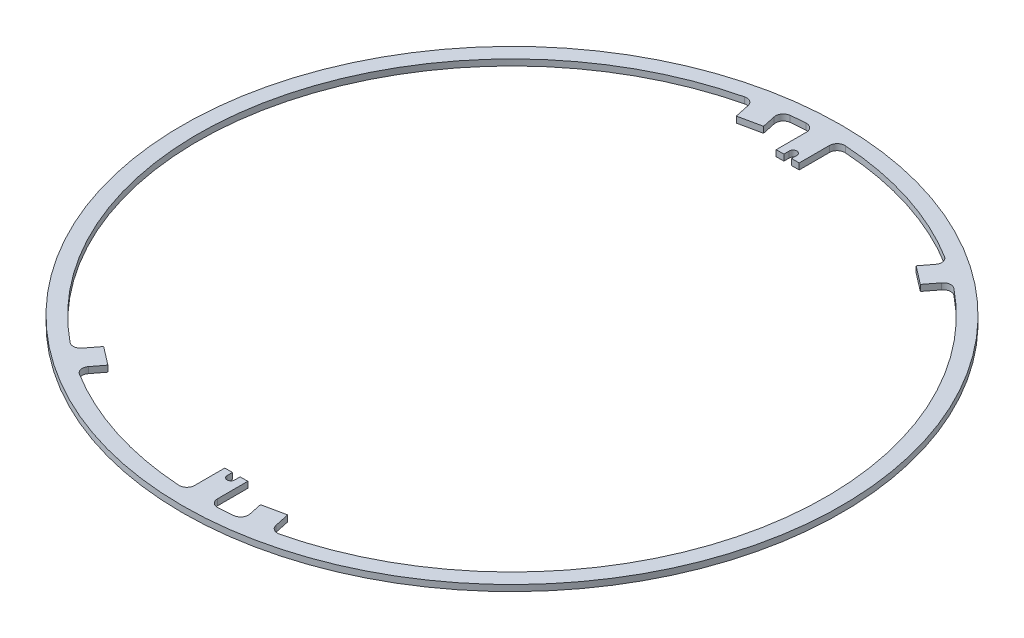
ISO-10303-21;
HEADER;
FILE_DESCRIPTION(('STEP AP214'),'2;1');
FILE_NAME('part.step','',(''),(''),'','','');
FILE_SCHEMA(('AUTOMOTIVE_DESIGN { 1 0 10303 214 1 1 1 1 }'));
ENDSEC;
DATA;
#1=APPLICATION_CONTEXT('core data for automotive mechanical design processes');
#2=APPLICATION_PROTOCOL_DEFINITION('international standard','automotive_design',2000,#1);
#3=PRODUCT_CONTEXT('',#1,'mechanical');
#4=PRODUCT('Part','Part','',(#3));
#5=PRODUCT_RELATED_PRODUCT_CATEGORY('part','',(#4));
#6=PRODUCT_DEFINITION_FORMATION('','',#4);
#7=PRODUCT_DEFINITION_CONTEXT('part definition',#1,'design');
#8=PRODUCT_DEFINITION('design','',#6,#7);
#9=PRODUCT_DEFINITION_SHAPE('','',#8);
#10=(LENGTH_UNIT() NAMED_UNIT(*) SI_UNIT(.MILLI.,.METRE.));
#11=(NAMED_UNIT(*) PLANE_ANGLE_UNIT() SI_UNIT($,.RADIAN.));
#12=(NAMED_UNIT(*) SI_UNIT($,.STERADIAN.) SOLID_ANGLE_UNIT());
#13=UNCERTAINTY_MEASURE_WITH_UNIT(LENGTH_MEASURE(1.E-05),#10,'distance_accuracy_value','');
#14=(GEOMETRIC_REPRESENTATION_CONTEXT(3) GLOBAL_UNCERTAINTY_ASSIGNED_CONTEXT((#13)) GLOBAL_UNIT_ASSIGNED_CONTEXT((#10,
#11,#12)) REPRESENTATION_CONTEXT('',''));
#15=CARTESIAN_POINT('',(0.,0.,0.));
#16=DIRECTION('',(0.,0.,1.));
#17=DIRECTION('',(1.,0.,0.));
#18=AXIS2_PLACEMENT_3D('',#15,#16,#17);
#19=CARTESIAN_POINT('',(0.,0.8,0.));
#20=DIRECTION('',(0.,-1.,0.));
#21=DIRECTION('',(0.,0.,-1.));
#22=AXIS2_PLACEMENT_3D('',#19,#20,#21);
#23=CYLINDRICAL_SURFACE('',#22,41.);
#24=CARTESIAN_POINT('',(0.,0.8,0.));
#25=DIRECTION('',(0.,1.,0.));
#26=DIRECTION('',(0.,0.,1.));
#27=AXIS2_PLACEMENT_3D('',#24,#25,#26);
#28=CIRCLE('',#27,41.);
#29=CARTESIAN_POINT('',(-2.5625,0.8,-40.9198435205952));
#30=VERTEX_POINT('',#29);
#31=CARTESIAN_POINT('',(-4.47124517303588,0.8,-40.7554654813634));
#32=VERTEX_POINT('',#31);
#33=EDGE_CURVE('E508',#30,#32,#28,.T.);
#34=ORIENTED_EDGE('',*,*,#33,.T.);
#35=DIRECTION('',(0.,-1.,0.));
#36=VECTOR('',#35,1.);
#37=CARTESIAN_POINT('',(-4.47124517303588,0.8,-40.7554654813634));
#38=LINE('',#37,#36);
#39=CARTESIAN_POINT('',(-4.47124517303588,0.,-40.7554654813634));
#40=VERTEX_POINT('',#39);
#41=EDGE_CURVE('E610',#32,#40,#38,.T.);
#42=ORIENTED_EDGE('',*,*,#41,.T.);
#43=CARTESIAN_POINT('',(0.,0.,0.));
#44=DIRECTION('',(0.,1.,0.));
#45=DIRECTION('',(0.,0.,1.));
#46=AXIS2_PLACEMENT_3D('',#43,#44,#45);
#47=CIRCLE('',#46,41.);
#48=CARTESIAN_POINT('',(-2.5625,0.,-40.9198435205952));
#49=VERTEX_POINT('',#48);
#50=EDGE_CURVE('E514',#49,#40,#47,.T.);
#51=ORIENTED_EDGE('',*,*,#50,.F.);
#52=DIRECTION('',(0.,-1.,0.));
#53=VECTOR('',#52,1.);
#54=CARTESIAN_POINT('',(-2.5625,0.8,-40.9198435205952));
#55=LINE('',#54,#53);
#56=EDGE_CURVE('E526',#49,#30,#55,.F.);
#57=ORIENTED_EDGE('',*,*,#56,.T.);
#58=EDGE_LOOP('',(#34,#42,#51,#57));
#59=FACE_BOUND('',#58,.T.);
#60=ADVANCED_FACE('F37',(#59),#23,.F.);
#61=CARTESIAN_POINT('',(9.52431632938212,0.,39.8784076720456));
#62=VERTEX_POINT('',#61);
#63=CARTESIAN_POINT('',(25.7646047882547,0.,-31.8933400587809));
#64=VERTEX_POINT('',#63);
#65=EDGE_CURVE('E513',#62,#64,#47,.T.);
#66=ORIENTED_EDGE('',*,*,#65,.F.);
#67=DIRECTION('',(0.,-1.,0.));
#68=VECTOR('',#67,1.);
#69=CARTESIAN_POINT('',(9.52431632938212,0.8,39.8784076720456));
#70=LINE('',#69,#68);
#71=CARTESIAN_POINT('',(9.52431632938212,0.8,39.8784076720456));
#72=VERTEX_POINT('',#71);
#73=EDGE_CURVE('E58',#62,#72,#70,.F.);
#74=ORIENTED_EDGE('',*,*,#73,.T.);
#75=CARTESIAN_POINT('',(25.7646047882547,0.8,-31.8933400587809));
#76=VERTEX_POINT('',#75);
#77=EDGE_CURVE('E507',#72,#76,#28,.T.);
#78=ORIENTED_EDGE('',*,*,#77,.T.);
#79=DIRECTION('',(0.,-1.,0.));
#80=VECTOR('',#79,1.);
#81=CARTESIAN_POINT('',(25.7646047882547,0.8,-31.8933400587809));
#82=LINE('',#81,#80);
#83=EDGE_CURVE('E573',#76,#64,#82,.T.);
#84=ORIENTED_EDGE('',*,*,#83,.T.);
#85=EDGE_LOOP('',(#66,#74,#78,#84));
#86=FACE_BOUND('',#85,.T.);
#87=ADVANCED_FACE('F727',(#86),#23,.F.);
#88=CARTESIAN_POINT('',(2.5625,0.8,40.9198435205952));
#89=VERTEX_POINT('',#88);
#90=CARTESIAN_POINT('',(4.47124517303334,0.8,40.7554654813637));
#91=VERTEX_POINT('',#90);
#92=EDGE_CURVE('E503',#89,#91,#28,.T.);
#93=ORIENTED_EDGE('',*,*,#92,.T.);
#94=DIRECTION('',(0.,-1.,0.));
#95=VECTOR('',#94,1.);
#96=CARTESIAN_POINT('',(4.47124517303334,0.8,40.7554654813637));
#97=LINE('',#96,#95);
#98=CARTESIAN_POINT('',(4.47124517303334,0.,40.7554654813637));
#99=VERTEX_POINT('',#98);
#100=EDGE_CURVE('E618',#91,#99,#97,.T.);
#101=ORIENTED_EDGE('',*,*,#100,.T.);
#102=CARTESIAN_POINT('',(2.5625,0.,40.9198435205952));
#103=VERTEX_POINT('',#102);
#104=EDGE_CURVE('E509',#103,#99,#47,.T.);
#105=ORIENTED_EDGE('',*,*,#104,.F.);
#106=DIRECTION('',(0.,-1.,0.));
#107=VECTOR('',#106,1.);
#108=CARTESIAN_POINT('',(2.5625,0.8,40.9198435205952));
#109=LINE('',#108,#107);
#110=EDGE_CURVE('E540',#103,#89,#109,.F.);
#111=ORIENTED_EDGE('',*,*,#110,.T.);
#112=EDGE_LOOP('',(#93,#101,#105,#111));
#113=FACE_BOUND('',#112,.T.);
#114=ADVANCED_FACE('F649',(#113),#23,.F.);
#115=CARTESIAN_POINT('',(-9.52431632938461,0.,-39.878407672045));
#116=VERTEX_POINT('',#115);
#117=CARTESIAN_POINT('',(-25.7646047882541,0.,31.8933400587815));
#118=VERTEX_POINT('',#117);
#119=EDGE_CURVE('E757',#116,#118,#47,.T.);
#120=ORIENTED_EDGE('',*,*,#119,.F.);
#121=DIRECTION('',(0.,-1.,0.));
#122=VECTOR('',#121,1.);
#123=CARTESIAN_POINT('',(-9.52431632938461,0.8,-39.878407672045));
#124=LINE('',#123,#122);
#125=CARTESIAN_POINT('',(-9.52431632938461,0.8,-39.878407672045));
#126=VERTEX_POINT('',#125);
#127=EDGE_CURVE('E616',#116,#126,#124,.F.);
#128=ORIENTED_EDGE('',*,*,#127,.T.);
#129=CARTESIAN_POINT('',(-25.7646047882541,0.8,31.8933400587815));
#130=VERTEX_POINT('',#129);
#131=EDGE_CURVE('E669',#126,#130,#28,.T.);
#132=ORIENTED_EDGE('',*,*,#131,.T.);
#133=DIRECTION('',(0.,-1.,0.));
#134=VECTOR('',#133,1.);
#135=CARTESIAN_POINT('',(-25.7646047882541,0.8,31.8933400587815));
#136=LINE('',#135,#134);
#137=EDGE_CURVE('E589',#130,#118,#136,.T.);
#138=ORIENTED_EDGE('',*,*,#137,.T.);
#139=EDGE_LOOP('',(#120,#128,#132,#138));
#140=FACE_BOUND('',#139,.T.);
#141=ADVANCED_FACE('F743',(#140),#23,.F.);
#142=CARTESIAN_POINT('',(0.,-5.85450557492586,35.9725517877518));
#143=DIRECTION('',(0.,0.,1.));
#144=DIRECTION('',(1.,0.,0.));
#145=AXIS2_PLACEMENT_3D('',#142,#143,#144);
#146=PLANE('',#145);
#147=DIRECTION('',(-1.,0.,0.));
#148=VECTOR('',#147,1.);
#149=CARTESIAN_POINT('',(0.,0.,35.9725517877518));
#150=LINE('',#149,#148);
#151=CARTESIAN_POINT('',(1.5,0.,35.9725517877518));
#152=VERTEX_POINT('',#151);
#153=CARTESIAN_POINT('',(0.5,0.,35.9725517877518));
#154=VERTEX_POINT('',#153);
#155=EDGE_CURVE('E483',#152,#154,#150,.T.);
#156=ORIENTED_EDGE('',*,*,#155,.T.);
#157=DIRECTION('',(0.,1.,0.));
#158=VECTOR('',#157,1.);
#159=CARTESIAN_POINT('',(0.5,-5.85450557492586,35.9725517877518));
#160=LINE('',#159,#158);
#161=CARTESIAN_POINT('',(0.5,0.8,35.9725517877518));
#162=VERTEX_POINT('',#161);
#163=EDGE_CURVE('E567',#154,#162,#160,.T.);
#164=ORIENTED_EDGE('',*,*,#163,.T.);
#165=DIRECTION('',(1.,0.,0.));
#166=VECTOR('',#165,1.);
#167=CARTESIAN_POINT('',(0.,0.8,35.9725517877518));
#168=LINE('',#167,#166);
#169=CARTESIAN_POINT('',(1.5,0.8,35.9725517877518));
#170=VERTEX_POINT('',#169);
#171=EDGE_CURVE('E464',#162,#170,#168,.T.);
#172=ORIENTED_EDGE('',*,*,#171,.T.);
#173=DIRECTION('',(0.,1.,0.));
#174=VECTOR('',#173,1.);
#175=CARTESIAN_POINT('',(1.5,-5.85450557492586,35.9725517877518));
#176=LINE('',#175,#174);
#177=EDGE_CURVE('E496',#152,#170,#176,.T.);
#178=ORIENTED_EDGE('',*,*,#177,.F.);
#179=EDGE_LOOP('',(#156,#164,#172,#178));
#180=FACE_BOUND('',#179,.T.);
#181=ADVANCED_FACE('F704',(#180),#146,.F.);
#182=CARTESIAN_POINT('',(0.,-5.85450557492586,-35.9725517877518));
#183=DIRECTION('',(0.,0.,1.));
#184=DIRECTION('',(1.,0.,0.));
#185=AXIS2_PLACEMENT_3D('',#182,#183,#184);
#186=PLANE('',#185);
#187=DIRECTION('',(0.,-1.,0.));
#188=VECTOR('',#187,1.);
#189=CARTESIAN_POINT('',(-0.5,-5.85450557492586,-35.9725517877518));
#190=LINE('',#189,#188);
#191=CARTESIAN_POINT('',(-0.5,0.8,-35.9725517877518));
#192=VERTEX_POINT('',#191);
#193=CARTESIAN_POINT('',(-0.5,0.,-35.9725517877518));
#194=VERTEX_POINT('',#193);
#195=EDGE_CURVE('E562',#192,#194,#190,.T.);
#196=ORIENTED_EDGE('',*,*,#195,.F.);
#197=DIRECTION('',(1.,0.,0.));
#198=VECTOR('',#197,1.);
#199=CARTESIAN_POINT('',(0.,0.8,-35.9725517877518));
#200=LINE('',#199,#198);
#201=CARTESIAN_POINT('',(-1.5,0.8,-35.9725517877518));
#202=VERTEX_POINT('',#201);
#203=EDGE_CURVE('E470',#202,#192,#200,.T.);
#204=ORIENTED_EDGE('',*,*,#203,.F.);
#205=DIRECTION('',(0.,1.,0.));
#206=VECTOR('',#205,1.);
#207=CARTESIAN_POINT('',(-1.5,-5.85450557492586,-35.9725517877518));
#208=LINE('',#207,#206);
#209=CARTESIAN_POINT('',(-1.5,0.,-35.9725517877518));
#210=VERTEX_POINT('',#209);
#211=EDGE_CURVE('E473',#210,#202,#208,.T.);
#212=ORIENTED_EDGE('',*,*,#211,.F.);
#213=DIRECTION('',(-1.,0.,0.));
#214=VECTOR('',#213,1.);
#215=CARTESIAN_POINT('',(0.,0.,-35.9725517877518));
#216=LINE('',#215,#214);
#217=EDGE_CURVE('E456',#194,#210,#216,.T.);
#218=ORIENTED_EDGE('',*,*,#217,.F.);
#219=EDGE_LOOP('',(#196,#204,#212,#218));
#220=FACE_BOUND('',#219,.T.);
#221=ADVANCED_FACE('F741',(#220),#186,.T.);
#222=CARTESIAN_POINT('',(21.5813602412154,0.,-34.8603627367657));
#223=VERTEX_POINT('',#222);
#224=CARTESIAN_POINT('',(2.5625,0.,-40.9198435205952));
#225=VERTEX_POINT('',#224);
#226=EDGE_CURVE('E1201',#223,#225,#47,.T.);
#227=ORIENTED_EDGE('',*,*,#226,.F.);
#228=DIRECTION('',(0.,-1.,0.));
#229=VECTOR('',#228,1.);
#230=CARTESIAN_POINT('',(21.5813602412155,0.8,-34.8603627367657));
#231=LINE('',#230,#229);
#232=CARTESIAN_POINT('',(21.5813602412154,0.8,-34.8603627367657));
#233=VERTEX_POINT('',#232);
#234=EDGE_CURVE('E576',#223,#233,#231,.F.);
#235=ORIENTED_EDGE('',*,*,#234,.T.);
#236=CARTESIAN_POINT('',(2.5625,0.8,-40.9198435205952));
#237=VERTEX_POINT('',#236);
#238=EDGE_CURVE('E668',#233,#237,#28,.T.);
#239=ORIENTED_EDGE('',*,*,#238,.T.);
#240=DIRECTION('',(0.,-1.,0.));
#241=VECTOR('',#240,1.);
#242=CARTESIAN_POINT('',(2.5625,0.8,-40.9198435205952));
#243=LINE('',#242,#241);
#244=EDGE_CURVE('E523',#237,#225,#243,.T.);
#245=ORIENTED_EDGE('',*,*,#244,.T.);
#246=EDGE_LOOP('',(#227,#235,#239,#245));
#247=FACE_BOUND('',#246,.T.);
#248=ADVANCED_FACE('F736',(#247),#23,.F.);
#249=CARTESIAN_POINT('',(-21.5813602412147,0.,34.8603627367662));
#250=VERTEX_POINT('',#249);
#251=CARTESIAN_POINT('',(-2.5625,0.,40.9198435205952));
#252=VERTEX_POINT('',#251);
#253=EDGE_CURVE('E486',#250,#252,#47,.T.);
#254=ORIENTED_EDGE('',*,*,#253,.F.);
#255=DIRECTION('',(0.,-1.,0.));
#256=VECTOR('',#255,1.);
#257=CARTESIAN_POINT('',(-21.5813602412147,0.8,34.8603627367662));
#258=LINE('',#257,#256);
#259=CARTESIAN_POINT('',(-21.5813602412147,0.8,34.8603627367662));
#260=VERTEX_POINT('',#259);
#261=EDGE_CURVE('E581',#250,#260,#258,.F.);
#262=ORIENTED_EDGE('',*,*,#261,.T.);
#263=CARTESIAN_POINT('',(-2.5625,0.8,40.9198435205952));
#264=VERTEX_POINT('',#263);
#265=EDGE_CURVE('E512',#260,#264,#28,.T.);
#266=ORIENTED_EDGE('',*,*,#265,.T.);
#267=DIRECTION('',(0.,-1.,0.));
#268=VECTOR('',#267,1.);
#269=CARTESIAN_POINT('',(-2.5625,0.8,40.9198435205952));
#270=LINE('',#269,#268);
#271=EDGE_CURVE('E548',#264,#252,#270,.T.);
#272=ORIENTED_EDGE('',*,*,#271,.T.);
#273=EDGE_LOOP('',(#254,#262,#266,#272));
#274=FACE_BOUND('',#273,.T.);
#275=ADVANCED_FACE('F676',(#274),#23,.F.);
#276=CARTESIAN_POINT('',(0.,0.8,0.));
#277=DIRECTION('',(0.,1.,0.));
#278=DIRECTION('',(0.,0.,1.));
#279=AXIS2_PLACEMENT_3D('',#276,#277,#278);
#280=PLANE('',#279);
#281=DIRECTION('',(0.,0.,1.));
#282=VECTOR('',#281,1.);
#283=CARTESIAN_POINT('',(0.5,0.8,33.6725517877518));
#284=LINE('',#283,#282);
#285=CARTESIAN_POINT('',(0.5,0.8,36.6725517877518));
#286=VERTEX_POINT('',#285);
#287=EDGE_CURVE('E418',#162,#286,#284,.T.);
#288=ORIENTED_EDGE('',*,*,#287,.T.);
#289=CARTESIAN_POINT('',(0.,0.8,36.6725517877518));
#290=DIRECTION('',(0.,-1.,0.));
#291=DIRECTION('',(0.,0.,-1.));
#292=AXIS2_PLACEMENT_3D('',#289,#290,#291);
#293=CIRCLE('',#292,0.5);
#294=CARTESIAN_POINT('',(-0.5,0.8,36.6725517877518));
#295=VERTEX_POINT('',#294);
#296=EDGE_CURVE('E411',#286,#295,#293,.T.);
#297=ORIENTED_EDGE('',*,*,#296,.T.);
#298=DIRECTION('',(0.,0.,-1.));
#299=VECTOR('',#298,1.);
#300=CARTESIAN_POINT('',(-0.5,0.8,36.6725517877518));
#301=LINE('',#300,#299);
#302=CARTESIAN_POINT('',(-0.5,0.8,35.9725517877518));
#303=VERTEX_POINT('',#302);
#304=EDGE_CURVE('E414',#295,#303,#301,.T.);
#305=ORIENTED_EDGE('',*,*,#304,.T.);
#306=CARTESIAN_POINT('',(-1.5,0.8,35.9725517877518));
#307=VERTEX_POINT('',#306);
#308=EDGE_CURVE('E487',#307,#303,#168,.T.);
#309=ORIENTED_EDGE('',*,*,#308,.F.);
#310=DIRECTION('',(0.,0.,-1.));
#311=VECTOR('',#310,1.);
#312=CARTESIAN_POINT('',(-1.49999999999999,0.8,0.));
#313=LINE('',#312,#311);
#314=CARTESIAN_POINT('',(-1.5,0.8,39.9217985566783));
#315=VERTEX_POINT('',#314);
#316=EDGE_CURVE('E490',#315,#307,#313,.T.);
#317=ORIENTED_EDGE('',*,*,#316,.F.);
#318=CARTESIAN_POINT('',(-2.5,0.8,39.9217985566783));
#319=DIRECTION('',(0.,1.,0.));
#320=DIRECTION('',(0.,0.,1.));
#321=AXIS2_PLACEMENT_3D('',#318,#319,#320);
#322=CIRCLE('',#321,1.);
#323=EDGE_CURVE('E555',#315,#264,#322,.F.);
#324=ORIENTED_EDGE('',*,*,#323,.T.);
#325=ORIENTED_EDGE('',*,*,#265,.F.);
#326=CARTESIAN_POINT('',(-21.0549856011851,0.8,34.0101099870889));
#327=DIRECTION('',(0.,1.,0.));
#328=DIRECTION('',(0.,0.,1.));
#329=AXIS2_PLACEMENT_3D('',#326,#327,#328);
#330=CIRCLE('',#329,1.);
#331=CARTESIAN_POINT('',(-21.8483389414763,0.8,33.4013485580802));
#332=VERTEX_POINT('',#331);
#333=EDGE_CURVE('E601',#260,#332,#330,.F.);
#334=ORIENTED_EDGE('',*,*,#333,.T.);
#335=DIRECTION('',(0.608761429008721,0.,-0.793353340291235));
#336=VECTOR('',#335,1.);
#337=CARTESIAN_POINT('',(-20.7528742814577,0.8,31.9737112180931));
#338=LINE('',#337,#336);
#339=CARTESIAN_POINT('',(-20.7528742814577,0.8,31.9737112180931));
#340=VERTEX_POINT('',#339);
#341=EDGE_CURVE('E390',#332,#340,#338,.T.);
#342=ORIENTED_EDGE('',*,*,#341,.T.);
#343=DIRECTION('',(-0.793353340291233,0.,-0.608761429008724));
#344=VECTOR('',#343,1.);
#345=CARTESIAN_POINT('',(-23.1329343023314,0.8,30.1474269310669));
#346=LINE('',#345,#344);
#347=CARTESIAN_POINT('',(-23.1329343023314,0.8,30.1474269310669));
#348=VERTEX_POINT('',#347);
#349=EDGE_CURVE('E398',#340,#348,#346,.T.);
#350=ORIENTED_EDGE('',*,*,#349,.T.);
#351=DIRECTION('',(-0.60876142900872,0.,0.793353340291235));
#352=VECTOR('',#351,1.);
#353=CARTESIAN_POINT('',(-24.9592185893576,0.8,32.5274869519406));
#354=LINE('',#353,#352);
#355=CARTESIAN_POINT('',(-24.3428464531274,0.8,31.7242151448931));
#356=VERTEX_POINT('',#355);
#357=EDGE_CURVE('E401',#348,#356,#354,.T.);
#358=ORIENTED_EDGE('',*,*,#357,.T.);
#359=CARTESIAN_POINT('',(-25.1361997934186,0.8,31.1154537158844));
#360=DIRECTION('',(0.,1.,0.));
#361=DIRECTION('',(0.,0.,1.));
#362=AXIS2_PLACEMENT_3D('',#359,#360,#361);
#363=CIRCLE('',#362,1.);
#364=EDGE_CURVE('E605',#356,#130,#363,.F.);
#365=ORIENTED_EDGE('',*,*,#364,.T.);
#366=ORIENTED_EDGE('',*,*,#131,.F.);
#367=CARTESIAN_POINT('',(-9.29201593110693,0.8,-38.9057635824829));
#368=DIRECTION('',(0.,1.,0.));
#369=DIRECTION('',(0.,0.,1.));
#370=AXIS2_PLACEMENT_3D('',#367,#368,#369);
#371=CIRCLE('',#370,1.);
#372=CARTESIAN_POINT('',(-8.31386833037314,0.8,-39.1136752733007));
#373=VERTEX_POINT('',#372);
#374=EDGE_CURVE('E633',#126,#373,#371,.F.);
#375=ORIENTED_EDGE('',*,*,#374,.T.);
#376=DIRECTION('',(-0.207911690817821,0.,-0.978147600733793));
#377=VECTOR('',#376,1.);
#378=CARTESIAN_POINT('',(-8.52437932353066,0.8,-40.1040516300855));
#379=LINE('',#378,#377);
#380=CARTESIAN_POINT('',(-7.9006442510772,0.8,-37.1696088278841));
#381=VERTEX_POINT('',#380);
#382=EDGE_CURVE('E327',#381,#373,#379,.T.);
#383=ORIENTED_EDGE('',*,*,#382,.F.);
#384=DIRECTION('',(-0.978147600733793,0.,0.20791169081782));
#385=VECTOR('',#384,1.);
#386=CARTESIAN_POINT('',(-7.9006442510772,0.8,-37.1696088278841));
#387=LINE('',#386,#385);
#388=CARTESIAN_POINT('',(-4.96620144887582,0.8,-37.7933439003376));
#389=VERTEX_POINT('',#388);
#390=EDGE_CURVE('E324',#389,#381,#387,.T.);
#391=ORIENTED_EDGE('',*,*,#390,.F.);
#392=DIRECTION('',(0.20791169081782,0.,0.978147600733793));
#393=VECTOR('',#392,1.);
#394=CARTESIAN_POINT('',(-4.96620144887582,0.8,-37.7933439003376));
#395=LINE('',#394,#393);
#396=CARTESIAN_POINT('',(-5.34033801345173,0.8,-39.5535180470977));
#397=VERTEX_POINT('',#396);
#398=EDGE_CURVE('E341',#397,#389,#395,.T.);
#399=ORIENTED_EDGE('',*,*,#398,.F.);
#400=CARTESIAN_POINT('',(-4.36219041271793,0.8,-39.7614297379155));
#401=DIRECTION('',(0.,1.,0.));
#402=DIRECTION('',(0.,0.,1.));
#403=AXIS2_PLACEMENT_3D('',#400,#401,#402);
#404=CIRCLE('',#403,1.);
#405=EDGE_CURVE('E629',#397,#32,#404,.F.);
#406=ORIENTED_EDGE('',*,*,#405,.T.);
#407=ORIENTED_EDGE('',*,*,#33,.F.);
#408=CARTESIAN_POINT('',(-2.5,0.8,-39.9217985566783));
#409=DIRECTION('',(0.,1.,0.));
#410=DIRECTION('',(0.,0.,1.));
#411=AXIS2_PLACEMENT_3D('',#408,#409,#410);
#412=CIRCLE('',#411,1.);
#413=CARTESIAN_POINT('',(-1.5,0.8,-39.9217985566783));
#414=VERTEX_POINT('',#413);
#415=EDGE_CURVE('E536',#30,#414,#412,.F.);
#416=ORIENTED_EDGE('',*,*,#415,.T.);
#417=DIRECTION('',(0.,0.,1.));
#418=VECTOR('',#417,1.);
#419=CARTESIAN_POINT('',(-1.49999999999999,0.8,0.));
#420=LINE('',#419,#418);
#421=EDGE_CURVE('E467',#414,#202,#420,.T.);
#422=ORIENTED_EDGE('',*,*,#421,.T.);
#423=ORIENTED_EDGE('',*,*,#203,.T.);
#424=DIRECTION('',(0.,0.,-1.));
#425=VECTOR('',#424,1.);
#426=CARTESIAN_POINT('',(-0.5,0.8,-36.6725517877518));
#427=LINE('',#426,#425);
#428=CARTESIAN_POINT('',(-0.5,0.8,-36.6725517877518));
#429=VERTEX_POINT('',#428);
#430=EDGE_CURVE('E441',#192,#429,#427,.T.);
#431=ORIENTED_EDGE('',*,*,#430,.T.);
#432=CARTESIAN_POINT('',(0.,0.8,-36.6725517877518));
#433=DIRECTION('',(0.,-1.,0.));
#434=DIRECTION('',(0.,0.,1.));
#435=AXIS2_PLACEMENT_3D('',#432,#433,#434);
#436=CIRCLE('',#435,0.5);
#437=CARTESIAN_POINT('',(0.5,0.8,-36.6725517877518));
#438=VERTEX_POINT('',#437);
#439=EDGE_CURVE('E434',#429,#438,#436,.T.);
#440=ORIENTED_EDGE('',*,*,#439,.T.);
#441=DIRECTION('',(0.,0.,1.));
#442=VECTOR('',#441,1.);
#443=CARTESIAN_POINT('',(0.5,0.8,-33.6725517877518));
#444=LINE('',#443,#442);
#445=CARTESIAN_POINT('',(0.5,0.8,-35.9725517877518));
#446=VERTEX_POINT('',#445);
#447=EDGE_CURVE('E437',#438,#446,#444,.T.);
#448=ORIENTED_EDGE('',*,*,#447,.T.);
#449=CARTESIAN_POINT('',(1.5,0.8,-35.9725517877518));
#450=VERTEX_POINT('',#449);
#451=EDGE_CURVE('E469',#446,#450,#200,.T.);
#452=ORIENTED_EDGE('',*,*,#451,.T.);
#453=DIRECTION('',(0.,0.,1.));
#454=VECTOR('',#453,1.);
#455=CARTESIAN_POINT('',(1.49999999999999,0.8,0.));
#456=LINE('',#455,#454);
#457=CARTESIAN_POINT('',(1.5,0.8,-39.9217985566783));
#458=VERTEX_POINT('',#457);
#459=EDGE_CURVE('E432',#458,#450,#456,.T.);
#460=ORIENTED_EDGE('',*,*,#459,.F.);
#461=CARTESIAN_POINT('',(2.5,0.8,-39.9217985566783));
#462=DIRECTION('',(0.,1.,0.));
#463=DIRECTION('',(0.,0.,1.));
#464=AXIS2_PLACEMENT_3D('',#461,#462,#463);
#465=CIRCLE('',#464,1.);
#466=EDGE_CURVE('E531',#458,#237,#465,.F.);
#467=ORIENTED_EDGE('',*,*,#466,.T.);
#468=ORIENTED_EDGE('',*,*,#238,.F.);
#469=CARTESIAN_POINT('',(21.0549856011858,0.8,-34.0101099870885));
#470=DIRECTION('',(0.,1.,0.));
#471=DIRECTION('',(0.,0.,1.));
#472=AXIS2_PLACEMENT_3D('',#469,#470,#471);
#473=CIRCLE('',#472,1.);
#474=CARTESIAN_POINT('',(21.848338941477,0.8,-33.4013485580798));
#475=VERTEX_POINT('',#474);
#476=EDGE_CURVE('E597',#233,#475,#473,.F.);
#477=ORIENTED_EDGE('',*,*,#476,.T.);
#478=DIRECTION('',(-0.608761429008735,0.,0.793353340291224));
#479=VECTOR('',#478,1.);
#480=CARTESIAN_POINT('',(20.7528742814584,0.8,-31.9737112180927));
#481=LINE('',#480,#479);
#482=CARTESIAN_POINT('',(20.7528742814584,0.8,-31.9737112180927));
#483=VERTEX_POINT('',#482);
#484=EDGE_CURVE('E370',#475,#483,#481,.T.);
#485=ORIENTED_EDGE('',*,*,#484,.T.);
#486=DIRECTION('',(0.79335334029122,0.,0.60876142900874));
#487=VECTOR('',#486,1.);
#488=CARTESIAN_POINT('',(23.132934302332,0.8,-30.1474269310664));
#489=LINE('',#488,#487);
#490=CARTESIAN_POINT('',(23.132934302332,0.8,-30.1474269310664));
#491=VERTEX_POINT('',#490);
#492=EDGE_CURVE('E378',#483,#491,#489,.T.);
#493=ORIENTED_EDGE('',*,*,#492,.T.);
#494=DIRECTION('',(0.608761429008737,0.,-0.793353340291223));
#495=VECTOR('',#494,1.);
#496=CARTESIAN_POINT('',(24.9592185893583,0.8,-32.5274869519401));
#497=LINE('',#496,#495);
#498=CARTESIAN_POINT('',(24.342846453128,0.8,-31.7242151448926));
#499=VERTEX_POINT('',#498);
#500=EDGE_CURVE('E381',#491,#499,#497,.T.);
#501=ORIENTED_EDGE('',*,*,#500,.T.);
#502=CARTESIAN_POINT('',(25.1361997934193,0.8,-31.1154537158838));
#503=DIRECTION('',(0.,1.,0.));
#504=DIRECTION('',(0.,0.,1.));
#505=AXIS2_PLACEMENT_3D('',#502,#503,#504);
#506=CIRCLE('',#505,1.);
#507=EDGE_CURVE('E592',#499,#76,#506,.F.);
#508=ORIENTED_EDGE('',*,*,#507,.T.);
#509=ORIENTED_EDGE('',*,*,#77,.F.);
#510=CARTESIAN_POINT('',(9.29201593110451,0.8,38.9057635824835));
#511=DIRECTION('',(0.,1.,0.));
#512=DIRECTION('',(0.,0.,1.));
#513=AXIS2_PLACEMENT_3D('',#510,#511,#512);
#514=CIRCLE('',#513,1.);
#515=CARTESIAN_POINT('',(8.3138683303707,0.8,39.1136752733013));
#516=VERTEX_POINT('',#515);
#517=EDGE_CURVE('E11',#72,#516,#514,.F.);
#518=ORIENTED_EDGE('',*,*,#517,.T.);
#519=DIRECTION('',(0.207911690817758,0.,0.978147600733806));
#520=VECTOR('',#519,1.);
#521=CARTESIAN_POINT('',(8.52437932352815,0.8,40.104051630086));
#522=LINE('',#521,#520);
#523=CARTESIAN_POINT('',(7.90064425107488,0.8,37.1696088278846));
#524=VERTEX_POINT('',#523);
#525=EDGE_CURVE('E353',#524,#516,#522,.T.);
#526=ORIENTED_EDGE('',*,*,#525,.F.);
#527=DIRECTION('',(0.978147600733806,0.,-0.20791169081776));
#528=VECTOR('',#527,1.);
#529=CARTESIAN_POINT('',(7.90064425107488,0.8,37.1696088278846));
#530=LINE('',#529,#528);
#531=CARTESIAN_POINT('',(4.96620144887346,0.8,37.7933439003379));
#532=VERTEX_POINT('',#531);
#533=EDGE_CURVE('E361',#532,#524,#530,.T.);
#534=ORIENTED_EDGE('',*,*,#533,.F.);
#535=DIRECTION('',(-0.207911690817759,0.,-0.978147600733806));
#536=VECTOR('',#535,1.);
#537=CARTESIAN_POINT('',(4.96620144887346,0.8,37.7933439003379));
#538=LINE('',#537,#536);
#539=CARTESIAN_POINT('',(5.34033801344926,0.8,39.553518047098));
#540=VERTEX_POINT('',#539);
#541=EDGE_CURVE('E360',#540,#532,#538,.T.);
#542=ORIENTED_EDGE('',*,*,#541,.F.);
#543=CARTESIAN_POINT('',(4.36219041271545,0.8,39.7614297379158));
#544=DIRECTION('',(0.,1.,0.));
#545=DIRECTION('',(0.,0.,1.));
#546=AXIS2_PLACEMENT_3D('',#543,#544,#545);
#547=CIRCLE('',#546,1.);
#548=EDGE_CURVE('E637',#540,#91,#547,.F.);
#549=ORIENTED_EDGE('',*,*,#548,.T.);
#550=ORIENTED_EDGE('',*,*,#92,.F.);
#551=CARTESIAN_POINT('',(2.5,0.8,39.9217985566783));
#552=DIRECTION('',(0.,1.,0.));
#553=DIRECTION('',(0.,0.,1.));
#554=AXIS2_PLACEMENT_3D('',#551,#552,#553);
#555=CIRCLE('',#554,1.);
#556=CARTESIAN_POINT('',(1.5,0.8,39.9217985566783));
#557=VERTEX_POINT('',#556);
#558=EDGE_CURVE('E551',#89,#557,#555,.F.);
#559=ORIENTED_EDGE('',*,*,#558,.T.);
#560=DIRECTION('',(0.,0.,-1.));
#561=VECTOR('',#560,1.);
#562=CARTESIAN_POINT('',(1.49999999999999,0.8,0.));
#563=LINE('',#562,#561);
#564=EDGE_CURVE('E492',#557,#170,#563,.T.);
#565=ORIENTED_EDGE('',*,*,#564,.T.);
#566=ORIENTED_EDGE('',*,*,#171,.F.);
#567=EDGE_LOOP('',(#288,#297,#305,#309,#317,#324,#325,#334,#342,#350,#358,#365,#366,#375,#383,
#391,#399,#406,#407,#416,#422,#423,#431,#440,#448,#452,#460,#467,#468,#477,#485,#493,#501,#508,
#509,#518,#526,#534,#542,#549,#550,#559,#565,#566));
#568=FACE_BOUND('',#567,.T.);
#569=CARTESIAN_POINT('',(0.,0.8,0.));
#570=DIRECTION('',(0.,1.,0.));
#571=DIRECTION('',(0.,0.,1.));
#572=AXIS2_PLACEMENT_3D('',#569,#570,#571);
#573=CIRCLE('',#572,43.);
#574=CARTESIAN_POINT('',(0.,0.8,43.));
#575=VERTEX_POINT('',#574);
#576=EDGE_CURVE('E515',#575,#575,#573,.T.);
#577=ORIENTED_EDGE('',*,*,#576,.T.);
#578=EDGE_LOOP('',(#577));
#579=FACE_BOUND('',#578,.T.);
#580=ADVANCED_FACE('F642',(#568,#579),#280,.T.);
#581=CARTESIAN_POINT('',(0.,0.,0.));
#582=DIRECTION('',(0.,1.,0.));
#583=DIRECTION('',(0.,0.,1.));
#584=AXIS2_PLACEMENT_3D('',#581,#582,#583);
#585=PLANE('',#584);
#586=CARTESIAN_POINT('',(0.,0.,0.));
#587=DIRECTION('',(0.,1.,0.));
#588=DIRECTION('',(0.,0.,1.));
#589=AXIS2_PLACEMENT_3D('',#586,#587,#588);
#590=CIRCLE('',#589,43.);
#591=CARTESIAN_POINT('',(0.,0.,43.));
#592=VERTEX_POINT('',#591);
#593=EDGE_CURVE('E506',#592,#592,#590,.T.);
#594=ORIENTED_EDGE('',*,*,#593,.F.);
#595=EDGE_LOOP('',(#594));
#596=FACE_BOUND('',#595,.T.);
#597=CARTESIAN_POINT('',(0.,0.,36.6725517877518));
#598=DIRECTION('',(0.,-1.,0.));
#599=DIRECTION('',(0.,0.,-1.));
#600=AXIS2_PLACEMENT_3D('',#597,#598,#599);
#601=CIRCLE('',#600,0.5);
#602=CARTESIAN_POINT('',(0.5,0.,36.6725517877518));
#603=VERTEX_POINT('',#602);
#604=CARTESIAN_POINT('',(-0.5,0.,36.6725517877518));
#605=VERTEX_POINT('',#604);
#606=EDGE_CURVE('E422',#603,#605,#601,.T.);
#607=ORIENTED_EDGE('',*,*,#606,.F.);
#608=DIRECTION('',(0.,0.,1.));
#609=VECTOR('',#608,1.);
#610=CARTESIAN_POINT('',(0.5,0.,33.6725517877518));
#611=LINE('',#610,#609);
#612=EDGE_CURVE('E415',#154,#603,#611,.T.);
#613=ORIENTED_EDGE('',*,*,#612,.F.);
#614=ORIENTED_EDGE('',*,*,#155,.F.);
#615=DIRECTION('',(0.,0.,1.));
#616=VECTOR('',#615,1.);
#617=CARTESIAN_POINT('',(1.49999999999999,0.,0.));
#618=LINE('',#617,#616);
#619=CARTESIAN_POINT('',(1.5,0.,39.9217985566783));
#620=VERTEX_POINT('',#619);
#621=EDGE_CURVE('E478',#152,#620,#618,.T.);
#622=ORIENTED_EDGE('',*,*,#621,.T.);
#623=CARTESIAN_POINT('',(2.5,0.,39.9217985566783));
#624=DIRECTION('',(0.,1.,0.));
#625=DIRECTION('',(0.,0.,1.));
#626=AXIS2_PLACEMENT_3D('',#623,#624,#625);
#627=CIRCLE('',#626,1.);
#628=EDGE_CURVE('E553',#620,#103,#627,.T.);
#629=ORIENTED_EDGE('',*,*,#628,.T.);
#630=ORIENTED_EDGE('',*,*,#104,.T.);
#631=CARTESIAN_POINT('',(4.36219041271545,0.,39.7614297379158));
#632=DIRECTION('',(0.,1.,0.));
#633=DIRECTION('',(0.,0.,1.));
#634=AXIS2_PLACEMENT_3D('',#631,#632,#633);
#635=CIRCLE('',#634,1.);
#636=CARTESIAN_POINT('',(5.34033801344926,0.,39.553518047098));
#637=VERTEX_POINT('',#636);
#638=EDGE_CURVE('E635',#99,#637,#635,.T.);
#639=ORIENTED_EDGE('',*,*,#638,.T.);
#640=DIRECTION('',(-0.207911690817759,0.,-0.978147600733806));
#641=VECTOR('',#640,1.);
#642=CARTESIAN_POINT('',(4.96620144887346,0.,37.7933439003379));
#643=LINE('',#642,#641);
#644=CARTESIAN_POINT('',(4.96620144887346,0.,37.7933439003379));
#645=VERTEX_POINT('',#644);
#646=EDGE_CURVE('E351',#637,#645,#643,.T.);
#647=ORIENTED_EDGE('',*,*,#646,.T.);
#648=DIRECTION('',(0.978147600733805,0.,-0.20791169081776));
#649=VECTOR('',#648,1.);
#650=CARTESIAN_POINT('',(7.90064425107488,0.,37.1696088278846));
#651=LINE('',#650,#649);
#652=CARTESIAN_POINT('',(7.90064425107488,0.,37.1696088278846));
#653=VERTEX_POINT('',#652);
#654=EDGE_CURVE('E348',#645,#653,#651,.T.);
#655=ORIENTED_EDGE('',*,*,#654,.T.);
#656=DIRECTION('',(0.207911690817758,0.,0.978147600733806));
#657=VECTOR('',#656,1.);
#658=CARTESIAN_POINT('',(8.52437932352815,0.,40.104051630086));
#659=LINE('',#658,#657);
#660=CARTESIAN_POINT('',(8.3138683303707,0.,39.1136752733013));
#661=VERTEX_POINT('',#660);
#662=EDGE_CURVE('E354',#653,#661,#659,.T.);
#663=ORIENTED_EDGE('',*,*,#662,.T.);
#664=CARTESIAN_POINT('',(9.29201593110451,0.,38.9057635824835));
#665=DIRECTION('',(0.,1.,0.));
#666=DIRECTION('',(0.,0.,1.));
#667=AXIS2_PLACEMENT_3D('',#664,#665,#666);
#668=CIRCLE('',#667,1.);
#669=EDGE_CURVE('E45',#661,#62,#668,.T.);
#670=ORIENTED_EDGE('',*,*,#669,.T.);
#671=ORIENTED_EDGE('',*,*,#65,.T.);
#672=CARTESIAN_POINT('',(25.1361997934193,0.,-31.1154537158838));
#673=DIRECTION('',(0.,1.,0.));
#674=DIRECTION('',(0.,0.,1.));
#675=AXIS2_PLACEMENT_3D('',#672,#673,#674);
#676=CIRCLE('',#675,1.);
#677=CARTESIAN_POINT('',(24.342846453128,0.,-31.7242151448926));
#678=VERTEX_POINT('',#677);
#679=EDGE_CURVE('E595',#64,#678,#676,.T.);
#680=ORIENTED_EDGE('',*,*,#679,.T.);
#681=DIRECTION('',(-0.608761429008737,0.,0.793353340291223));
#682=VECTOR('',#681,1.);
#683=CARTESIAN_POINT('',(24.9592185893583,0.,-32.5274869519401));
#684=LINE('',#683,#682);
#685=CARTESIAN_POINT('',(23.132934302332,0.,-30.1474269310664));
#686=VERTEX_POINT('',#685);
#687=EDGE_CURVE('E373',#678,#686,#684,.T.);
#688=ORIENTED_EDGE('',*,*,#687,.T.);
#689=DIRECTION('',(-0.79335334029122,0.,-0.60876142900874));
#690=VECTOR('',#689,1.);
#691=CARTESIAN_POINT('',(23.132934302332,0.,-30.1474269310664));
#692=LINE('',#691,#690);
#693=CARTESIAN_POINT('',(20.7528742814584,0.,-31.9737112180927));
#694=VERTEX_POINT('',#693);
#695=EDGE_CURVE('E371',#686,#694,#692,.T.);
#696=ORIENTED_EDGE('',*,*,#695,.T.);
#697=DIRECTION('',(0.608761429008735,0.,-0.793353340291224));
#698=VECTOR('',#697,1.);
#699=CARTESIAN_POINT('',(20.7528742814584,0.,-31.9737112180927));
#700=LINE('',#699,#698);
#701=CARTESIAN_POINT('',(21.848338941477,0.,-33.4013485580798));
#702=VERTEX_POINT('',#701);
#703=EDGE_CURVE('E376',#694,#702,#700,.T.);
#704=ORIENTED_EDGE('',*,*,#703,.T.);
#705=CARTESIAN_POINT('',(21.0549856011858,0.,-34.0101099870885));
#706=DIRECTION('',(0.,1.,0.));
#707=DIRECTION('',(0.,0.,1.));
#708=AXIS2_PLACEMENT_3D('',#705,#706,#707);
#709=CIRCLE('',#708,1.);
#710=EDGE_CURVE('E599',#702,#223,#709,.T.);
#711=ORIENTED_EDGE('',*,*,#710,.T.);
#712=ORIENTED_EDGE('',*,*,#226,.T.);
#713=CARTESIAN_POINT('',(2.5,0.,-39.9217985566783));
#714=DIRECTION('',(0.,1.,0.));
#715=DIRECTION('',(0.,0.,1.));
#716=AXIS2_PLACEMENT_3D('',#713,#714,#715);
#717=CIRCLE('',#716,1.);
#718=CARTESIAN_POINT('',(1.5,0.,-39.9217985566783));
#719=VERTEX_POINT('',#718);
#720=EDGE_CURVE('E534',#225,#719,#717,.T.);
#721=ORIENTED_EDGE('',*,*,#720,.T.);
#722=DIRECTION('',(0.,0.,-1.));
#723=VECTOR('',#722,1.);
#724=CARTESIAN_POINT('',(1.49999999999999,0.,0.));
#725=LINE('',#724,#723);
#726=CARTESIAN_POINT('',(1.5,0.,-35.9725517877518));
#727=VERTEX_POINT('',#726);
#728=EDGE_CURVE('E461',#727,#719,#725,.T.);
#729=ORIENTED_EDGE('',*,*,#728,.F.);
#730=CARTESIAN_POINT('',(0.5,0.,-35.9725517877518));
#731=VERTEX_POINT('',#730);
#732=EDGE_CURVE('E458',#727,#731,#216,.T.);
#733=ORIENTED_EDGE('',*,*,#732,.T.);
#734=DIRECTION('',(0.,0.,1.));
#735=VECTOR('',#734,1.);
#736=CARTESIAN_POINT('',(0.5,0.,-33.6725517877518));
#737=LINE('',#736,#735);
#738=CARTESIAN_POINT('',(0.5,0.,-36.6725517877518));
#739=VERTEX_POINT('',#738);
#740=EDGE_CURVE('E447',#739,#731,#737,.T.);
#741=ORIENTED_EDGE('',*,*,#740,.F.);
#742=CARTESIAN_POINT('',(0.,0.,-36.6725517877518));
#743=DIRECTION('',(0.,-1.,0.));
#744=DIRECTION('',(0.,0.,1.));
#745=AXIS2_PLACEMENT_3D('',#742,#743,#744);
#746=CIRCLE('',#745,0.5);
#747=CARTESIAN_POINT('',(-0.5,0.,-36.6725517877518));
#748=VERTEX_POINT('',#747);
#749=EDGE_CURVE('E410',#748,#739,#746,.T.);
#750=ORIENTED_EDGE('',*,*,#749,.F.);
#751=DIRECTION('',(0.,0.,-1.));
#752=VECTOR('',#751,1.);
#753=CARTESIAN_POINT('',(-0.5,0.,-36.6725517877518));
#754=LINE('',#753,#752);
#755=EDGE_CURVE('E438',#194,#748,#754,.T.);
#756=ORIENTED_EDGE('',*,*,#755,.F.);
#757=ORIENTED_EDGE('',*,*,#217,.T.);
#758=DIRECTION('',(0.,0.,-1.));
#759=VECTOR('',#758,1.);
#760=CARTESIAN_POINT('',(-1.49999999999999,0.,0.));
#761=LINE('',#760,#759);
#762=CARTESIAN_POINT('',(-1.5,0.,-39.9217985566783));
#763=VERTEX_POINT('',#762);
#764=EDGE_CURVE('E453',#210,#763,#761,.T.);
#765=ORIENTED_EDGE('',*,*,#764,.T.);
#766=CARTESIAN_POINT('',(-2.5,0.,-39.9217985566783));
#767=DIRECTION('',(0.,1.,0.));
#768=DIRECTION('',(0.,0.,1.));
#769=AXIS2_PLACEMENT_3D('',#766,#767,#768);
#770=CIRCLE('',#769,1.);
#771=EDGE_CURVE('E538',#763,#49,#770,.T.);
#772=ORIENTED_EDGE('',*,*,#771,.T.);
#773=ORIENTED_EDGE('',*,*,#50,.T.);
#774=CARTESIAN_POINT('',(-4.36219041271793,0.,-39.7614297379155));
#775=DIRECTION('',(0.,1.,0.));
#776=DIRECTION('',(0.,0.,1.));
#777=AXIS2_PLACEMENT_3D('',#774,#775,#776);
#778=CIRCLE('',#777,1.);
#779=CARTESIAN_POINT('',(-5.34033801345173,0.,-39.5535180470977));
#780=VERTEX_POINT('',#779);
#781=EDGE_CURVE('E627',#40,#780,#778,.T.);
#782=ORIENTED_EDGE('',*,*,#781,.T.);
#783=DIRECTION('',(0.20791169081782,0.,0.978147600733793));
#784=VECTOR('',#783,1.);
#785=CARTESIAN_POINT('',(-4.96620144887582,0.,-37.7933439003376));
#786=LINE('',#785,#784);
#787=CARTESIAN_POINT('',(-4.96620144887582,0.,-37.7933439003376));
#788=VERTEX_POINT('',#787);
#789=EDGE_CURVE('E335',#780,#788,#786,.T.);
#790=ORIENTED_EDGE('',*,*,#789,.T.);
#791=DIRECTION('',(-0.978147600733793,0.,0.20791169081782));
#792=VECTOR('',#791,1.);
#793=CARTESIAN_POINT('',(-7.9006442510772,0.,-37.1696088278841));
#794=LINE('',#793,#792);
#795=CARTESIAN_POINT('',(-7.9006442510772,0.,-37.1696088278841));
#796=VERTEX_POINT('',#795);
#797=EDGE_CURVE('E322',#788,#796,#794,.T.);
#798=ORIENTED_EDGE('',*,*,#797,.T.);
#799=DIRECTION('',(-0.207911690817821,0.,-0.978147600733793));
#800=VECTOR('',#799,1.);
#801=CARTESIAN_POINT('',(-8.52437932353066,0.,-40.1040516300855));
#802=LINE('',#801,#800);
#803=CARTESIAN_POINT('',(-8.31386833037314,0.,-39.1136752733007));
#804=VERTEX_POINT('',#803);
#805=EDGE_CURVE('E331',#796,#804,#802,.T.);
#806=ORIENTED_EDGE('',*,*,#805,.T.);
#807=CARTESIAN_POINT('',(-9.29201593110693,0.,-38.9057635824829));
#808=DIRECTION('',(0.,1.,0.));
#809=DIRECTION('',(0.,0.,1.));
#810=AXIS2_PLACEMENT_3D('',#807,#808,#809);
#811=CIRCLE('',#810,1.);
#812=EDGE_CURVE('E631',#804,#116,#811,.T.);
#813=ORIENTED_EDGE('',*,*,#812,.T.);
#814=ORIENTED_EDGE('',*,*,#119,.T.);
#815=CARTESIAN_POINT('',(-25.1361997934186,0.,31.1154537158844));
#816=DIRECTION('',(0.,1.,0.));
#817=DIRECTION('',(0.,0.,1.));
#818=AXIS2_PLACEMENT_3D('',#815,#816,#817);
#819=CIRCLE('',#818,1.);
#820=CARTESIAN_POINT('',(-24.3428464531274,0.,31.7242151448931));
#821=VERTEX_POINT('',#820);
#822=EDGE_CURVE('E608',#118,#821,#819,.T.);
#823=ORIENTED_EDGE('',*,*,#822,.T.);
#824=DIRECTION('',(0.60876142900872,0.,-0.793353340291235));
#825=VECTOR('',#824,1.);
#826=CARTESIAN_POINT('',(-24.9592185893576,0.,32.5274869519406));
#827=LINE('',#826,#825);
#828=CARTESIAN_POINT('',(-23.1329343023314,0.,30.1474269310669));
#829=VERTEX_POINT('',#828);
#830=EDGE_CURVE('E393',#821,#829,#827,.T.);
#831=ORIENTED_EDGE('',*,*,#830,.T.);
#832=DIRECTION('',(0.793353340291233,0.,0.608761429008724));
#833=VECTOR('',#832,1.);
#834=CARTESIAN_POINT('',(-23.1329343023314,0.,30.1474269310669));
#835=LINE('',#834,#833);
#836=CARTESIAN_POINT('',(-20.7528742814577,0.,31.9737112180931));
#837=VERTEX_POINT('',#836);
#838=EDGE_CURVE('E391',#829,#837,#835,.T.);
#839=ORIENTED_EDGE('',*,*,#838,.T.);
#840=DIRECTION('',(-0.608761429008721,0.,0.793353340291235));
#841=VECTOR('',#840,1.);
#842=CARTESIAN_POINT('',(-20.7528742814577,0.,31.9737112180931));
#843=LINE('',#842,#841);
#844=CARTESIAN_POINT('',(-21.8483389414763,0.,33.4013485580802));
#845=VERTEX_POINT('',#844);
#846=EDGE_CURVE('E396',#837,#845,#843,.T.);
#847=ORIENTED_EDGE('',*,*,#846,.T.);
#848=CARTESIAN_POINT('',(-21.0549856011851,0.,34.0101099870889));
#849=DIRECTION('',(0.,1.,0.));
#850=DIRECTION('',(0.,0.,1.));
#851=AXIS2_PLACEMENT_3D('',#848,#849,#850);
#852=CIRCLE('',#851,1.);
#853=EDGE_CURVE('E603',#845,#250,#852,.T.);
#854=ORIENTED_EDGE('',*,*,#853,.T.);
#855=ORIENTED_EDGE('',*,*,#253,.T.);
#856=CARTESIAN_POINT('',(-2.5,0.,39.9217985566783));
#857=DIRECTION('',(0.,1.,0.));
#858=DIRECTION('',(0.,0.,1.));
#859=AXIS2_PLACEMENT_3D('',#856,#857,#858);
#860=CIRCLE('',#859,1.);
#861=CARTESIAN_POINT('',(-1.5,0.,39.9217985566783));
#862=VERTEX_POINT('',#861);
#863=EDGE_CURVE('E558',#252,#862,#860,.T.);
#864=ORIENTED_EDGE('',*,*,#863,.T.);
#865=DIRECTION('',(0.,0.,1.));
#866=VECTOR('',#865,1.);
#867=CARTESIAN_POINT('',(-1.49999999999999,0.,0.));
#868=LINE('',#867,#866);
#869=CARTESIAN_POINT('',(-1.5,0.,35.9725517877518));
#870=VERTEX_POINT('',#869);
#871=EDGE_CURVE('E482',#870,#862,#868,.T.);
#872=ORIENTED_EDGE('',*,*,#871,.F.);
#873=CARTESIAN_POINT('',(-0.5,0.,35.9725517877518));
#874=VERTEX_POINT('',#873);
#875=EDGE_CURVE('E481',#874,#870,#150,.T.);
#876=ORIENTED_EDGE('',*,*,#875,.F.);
#877=DIRECTION('',(0.,0.,-1.));
#878=VECTOR('',#877,1.);
#879=CARTESIAN_POINT('',(-0.5,0.,36.6725517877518));
#880=LINE('',#879,#878);
#881=EDGE_CURVE('E425',#605,#874,#880,.T.);
#882=ORIENTED_EDGE('',*,*,#881,.F.);
#883=EDGE_LOOP('',(#607,#613,#614,#622,#629,#630,#639,#647,#655,#663,#670,#671,#680,#688,#696,
#704,#711,#712,#721,#729,#733,#741,#750,#756,#757,#765,#772,#773,#782,#790,#798,#806,#813,#814,
#823,#831,#839,#847,#854,#855,#864,#872,#876,#882));
#884=FACE_BOUND('',#883,.T.);
#885=ADVANCED_FACE('F338',(#596,#884),#585,.F.);
#886=CARTESIAN_POINT('',(0.,0.8,0.));
#887=DIRECTION('',(0.,-1.,0.));
#888=DIRECTION('',(0.,0.,-1.));
#889=AXIS2_PLACEMENT_3D('',#886,#887,#888);
#890=CYLINDRICAL_SURFACE('',#889,43.);
#891=ORIENTED_EDGE('',*,*,#576,.F.);
#892=EDGE_LOOP('',(#891));
#893=FACE_BOUND('',#892,.T.);
#894=ORIENTED_EDGE('',*,*,#593,.T.);
#895=EDGE_LOOP('',(#894));
#896=FACE_BOUND('',#895,.T.);
#897=ADVANCED_FACE('F872',(#893,#896),#890,.T.);
#898=CARTESIAN_POINT('',(-1.49999999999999,-5.85450557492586,0.));
#899=DIRECTION('',(1.,0.,0.));
#900=DIRECTION('',(0.,0.,-1.));
#901=AXIS2_PLACEMENT_3D('',#898,#899,#900);
#902=PLANE('',#901);
#903=ORIENTED_EDGE('',*,*,#871,.T.);
#904=DIRECTION('',(0.,-1.,0.));
#905=VECTOR('',#904,1.);
#906=CARTESIAN_POINT('',(-1.5,-5.85450557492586,39.9217985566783));
#907=LINE('',#906,#905);
#908=EDGE_CURVE('E545',#862,#315,#907,.F.);
#909=ORIENTED_EDGE('',*,*,#908,.T.);
#910=ORIENTED_EDGE('',*,*,#316,.T.);
#911=DIRECTION('',(0.,1.,0.));
#912=VECTOR('',#911,1.);
#913=CARTESIAN_POINT('',(-1.5,-5.85450557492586,35.9725517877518));
#914=LINE('',#913,#912);
#915=EDGE_CURVE('E495',#870,#307,#914,.T.);
#916=ORIENTED_EDGE('',*,*,#915,.F.);
#917=EDGE_LOOP('',(#903,#909,#910,#916));
#918=FACE_BOUND('',#917,.T.);
#919=ADVANCED_FACE('F689',(#918),#902,.F.);
#920=CARTESIAN_POINT('',(1.49999999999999,-5.85450557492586,0.));
#921=DIRECTION('',(1.,0.,0.));
#922=DIRECTION('',(0.,0.,-1.));
#923=AXIS2_PLACEMENT_3D('',#920,#921,#922);
#924=PLANE('',#923);
#925=ORIENTED_EDGE('',*,*,#564,.F.);
#926=DIRECTION('',(0.,1.,0.));
#927=VECTOR('',#926,1.);
#928=CARTESIAN_POINT('',(1.5,0.,39.9217985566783));
#929=LINE('',#928,#927);
#930=EDGE_CURVE('E543',#557,#620,#929,.F.);
#931=ORIENTED_EDGE('',*,*,#930,.T.);
#932=ORIENTED_EDGE('',*,*,#621,.F.);
#933=ORIENTED_EDGE('',*,*,#177,.T.);
#934=EDGE_LOOP('',(#925,#931,#932,#933));
#935=FACE_BOUND('',#934,.T.);
#936=ADVANCED_FACE('F710',(#935),#924,.T.);
#937=ORIENTED_EDGE('',*,*,#308,.T.);
#938=DIRECTION('',(0.,-1.,0.));
#939=VECTOR('',#938,1.);
#940=CARTESIAN_POINT('',(-0.5,-5.85450557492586,35.9725517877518));
#941=LINE('',#940,#939);
#942=EDGE_CURVE('E564',#303,#874,#941,.T.);
#943=ORIENTED_EDGE('',*,*,#942,.T.);
#944=ORIENTED_EDGE('',*,*,#875,.T.);
#945=ORIENTED_EDGE('',*,*,#915,.T.);
#946=EDGE_LOOP('',(#937,#943,#944,#945));
#947=FACE_BOUND('',#946,.T.);
#948=ADVANCED_FACE('F691',(#947),#146,.F.);
#949=CARTESIAN_POINT('',(-1.49999999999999,-5.85450557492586,0.));
#950=DIRECTION('',(-1.,0.,0.));
#951=DIRECTION('',(0.,0.,1.));
#952=AXIS2_PLACEMENT_3D('',#949,#950,#951);
#953=PLANE('',#952);
#954=ORIENTED_EDGE('',*,*,#421,.F.);
#955=DIRECTION('',(0.,1.,0.));
#956=VECTOR('',#955,1.);
#957=CARTESIAN_POINT('',(-1.5,0.,-39.9217985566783));
#958=LINE('',#957,#956);
#959=EDGE_CURVE('E529',#414,#763,#958,.F.);
#960=ORIENTED_EDGE('',*,*,#959,.T.);
#961=ORIENTED_EDGE('',*,*,#764,.F.);
#962=ORIENTED_EDGE('',*,*,#211,.T.);
#963=EDGE_LOOP('',(#954,#960,#961,#962));
#964=FACE_BOUND('',#963,.T.);
#965=ADVANCED_FACE('F1068',(#964),#953,.T.);
#966=DIRECTION('',(0.,1.,0.));
#967=VECTOR('',#966,1.);
#968=CARTESIAN_POINT('',(0.5,-5.85450557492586,-35.9725517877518));
#969=LINE('',#968,#967);
#970=EDGE_CURVE('E560',#731,#446,#969,.T.);
#971=ORIENTED_EDGE('',*,*,#970,.F.);
#972=ORIENTED_EDGE('',*,*,#732,.F.);
#973=DIRECTION('',(0.,1.,0.));
#974=VECTOR('',#973,1.);
#975=CARTESIAN_POINT('',(1.5,-5.85450557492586,-35.9725517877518));
#976=LINE('',#975,#974);
#977=EDGE_CURVE('E457',#727,#450,#976,.T.);
#978=ORIENTED_EDGE('',*,*,#977,.T.);
#979=ORIENTED_EDGE('',*,*,#451,.F.);
#980=EDGE_LOOP('',(#971,#972,#978,#979));
#981=FACE_BOUND('',#980,.T.);
#982=ADVANCED_FACE('F749',(#981),#186,.T.);
#983=CARTESIAN_POINT('',(1.49999999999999,-5.85450557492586,0.));
#984=DIRECTION('',(-1.,0.,0.));
#985=DIRECTION('',(0.,0.,1.));
#986=AXIS2_PLACEMENT_3D('',#983,#984,#985);
#987=PLANE('',#986);
#988=ORIENTED_EDGE('',*,*,#728,.T.);
#989=DIRECTION('',(0.,-1.,0.));
#990=VECTOR('',#989,1.);
#991=CARTESIAN_POINT('',(1.5,-5.85450557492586,-39.9217985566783));
#992=LINE('',#991,#990);
#993=EDGE_CURVE('E518',#719,#458,#992,.F.);
#994=ORIENTED_EDGE('',*,*,#993,.T.);
#995=ORIENTED_EDGE('',*,*,#459,.T.);
#996=ORIENTED_EDGE('',*,*,#977,.F.);
#997=EDGE_LOOP('',(#988,#994,#995,#996));
#998=FACE_BOUND('',#997,.T.);
#999=ADVANCED_FACE('F1067',(#998),#987,.F.);
#1000=CARTESIAN_POINT('',(2.5,0.8,-39.9217985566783));
#1001=DIRECTION('',(0.,-1.,0.));
#1002=DIRECTION('',(0.,0.,-1.));
#1003=AXIS2_PLACEMENT_3D('',#1000,#1001,#1002);
#1004=CYLINDRICAL_SURFACE('',#1003,1.);
#1005=ORIENTED_EDGE('',*,*,#720,.F.);
#1006=ORIENTED_EDGE('',*,*,#244,.F.);
#1007=ORIENTED_EDGE('',*,*,#466,.F.);
#1008=ORIENTED_EDGE('',*,*,#993,.F.);
#1009=EDGE_LOOP('',(#1005,#1006,#1007,#1008));
#1010=FACE_BOUND('',#1009,.T.);
#1011=ADVANCED_FACE('F723',(#1010),#1004,.F.);
#1012=CARTESIAN_POINT('',(-2.5,0.8,-39.9217985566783));
#1013=DIRECTION('',(0.,-1.,0.));
#1014=DIRECTION('',(0.,0.,-1.));
#1015=AXIS2_PLACEMENT_3D('',#1012,#1013,#1014);
#1016=CYLINDRICAL_SURFACE('',#1015,1.);
#1017=ORIENTED_EDGE('',*,*,#771,.F.);
#1018=ORIENTED_EDGE('',*,*,#959,.F.);
#1019=ORIENTED_EDGE('',*,*,#415,.F.);
#1020=ORIENTED_EDGE('',*,*,#56,.F.);
#1021=EDGE_LOOP('',(#1017,#1018,#1019,#1020));
#1022=FACE_BOUND('',#1021,.T.);
#1023=ADVANCED_FACE('F715',(#1022),#1016,.F.);
#1024=CARTESIAN_POINT('',(2.5,0.8,39.9217985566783));
#1025=DIRECTION('',(0.,-1.,0.));
#1026=DIRECTION('',(0.,0.,-1.));
#1027=AXIS2_PLACEMENT_3D('',#1024,#1025,#1026);
#1028=CYLINDRICAL_SURFACE('',#1027,1.);
#1029=ORIENTED_EDGE('',*,*,#628,.F.);
#1030=ORIENTED_EDGE('',*,*,#930,.F.);
#1031=ORIENTED_EDGE('',*,*,#558,.F.);
#1032=ORIENTED_EDGE('',*,*,#110,.F.);
#1033=EDGE_LOOP('',(#1029,#1030,#1031,#1032));
#1034=FACE_BOUND('',#1033,.T.);
#1035=ADVANCED_FACE('F713',(#1034),#1028,.F.);
#1036=CARTESIAN_POINT('',(-2.5,0.8,39.9217985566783));
#1037=DIRECTION('',(0.,-1.,0.));
#1038=DIRECTION('',(0.,0.,-1.));
#1039=AXIS2_PLACEMENT_3D('',#1036,#1037,#1038);
#1040=CYLINDRICAL_SURFACE('',#1039,1.);
#1041=ORIENTED_EDGE('',*,*,#863,.F.);
#1042=ORIENTED_EDGE('',*,*,#271,.F.);
#1043=ORIENTED_EDGE('',*,*,#323,.F.);
#1044=ORIENTED_EDGE('',*,*,#908,.F.);
#1045=EDGE_LOOP('',(#1041,#1042,#1043,#1044));
#1046=FACE_BOUND('',#1045,.T.);
#1047=ADVANCED_FACE('F684',(#1046),#1040,.F.);
#1048=CARTESIAN_POINT('',(0.,0.8,-36.6725517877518));
#1049=DIRECTION('',(0.,-1.,0.));
#1050=DIRECTION('',(0.,0.,-1.));
#1051=AXIS2_PLACEMENT_3D('',#1048,#1049,#1050);
#1052=CYLINDRICAL_SURFACE('',#1051,0.5);
#1053=ORIENTED_EDGE('',*,*,#749,.T.);
#1054=DIRECTION('',(0.,-1.,0.));
#1055=VECTOR('',#1054,1.);
#1056=CARTESIAN_POINT('',(0.5,0.8,-36.6725517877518));
#1057=LINE('',#1056,#1055);
#1058=EDGE_CURVE('E444',#438,#739,#1057,.T.);
#1059=ORIENTED_EDGE('',*,*,#1058,.F.);
#1060=ORIENTED_EDGE('',*,*,#439,.F.);
#1061=DIRECTION('',(0.,-1.,0.));
#1062=VECTOR('',#1061,1.);
#1063=CARTESIAN_POINT('',(-0.5,0.8,-36.6725517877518));
#1064=LINE('',#1063,#1062);
#1065=EDGE_CURVE('E426',#429,#748,#1064,.T.);
#1066=ORIENTED_EDGE('',*,*,#1065,.T.);
#1067=EDGE_LOOP('',(#1053,#1059,#1060,#1066));
#1068=FACE_BOUND('',#1067,.T.);
#1069=ADVANCED_FACE('F721',(#1068),#1052,.F.);
#1070=CARTESIAN_POINT('',(-0.5,0.8,-36.6725517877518));
#1071=DIRECTION('',(-1.,0.,0.));
#1072=DIRECTION('',(0.,0.,1.));
#1073=AXIS2_PLACEMENT_3D('',#1070,#1071,#1072);
#1074=PLANE('',#1073);
#1075=ORIENTED_EDGE('',*,*,#195,.T.);
#1076=ORIENTED_EDGE('',*,*,#755,.T.);
#1077=ORIENTED_EDGE('',*,*,#1065,.F.);
#1078=ORIENTED_EDGE('',*,*,#430,.F.);
#1079=EDGE_LOOP('',(#1075,#1076,#1077,#1078));
#1080=FACE_BOUND('',#1079,.T.);
#1081=ADVANCED_FACE('F1038',(#1080),#1074,.F.);
#1082=CARTESIAN_POINT('',(0.5,0.8,-33.6725517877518));
#1083=DIRECTION('',(1.,0.,0.));
#1084=DIRECTION('',(0.,0.,-1.));
#1085=AXIS2_PLACEMENT_3D('',#1082,#1083,#1084);
#1086=PLANE('',#1085);
#1087=ORIENTED_EDGE('',*,*,#970,.T.);
#1088=ORIENTED_EDGE('',*,*,#447,.F.);
#1089=ORIENTED_EDGE('',*,*,#1058,.T.);
#1090=ORIENTED_EDGE('',*,*,#740,.T.);
#1091=EDGE_LOOP('',(#1087,#1088,#1089,#1090));
#1092=FACE_BOUND('',#1091,.T.);
#1093=ADVANCED_FACE('F1029',(#1092),#1086,.F.);
#1094=CARTESIAN_POINT('',(0.5,0.8,33.6725517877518));
#1095=DIRECTION('',(1.,0.,0.));
#1096=DIRECTION('',(0.,0.,-1.));
#1097=AXIS2_PLACEMENT_3D('',#1094,#1095,#1096);
#1098=PLANE('',#1097);
#1099=ORIENTED_EDGE('',*,*,#612,.T.);
#1100=DIRECTION('',(0.,-1.,0.));
#1101=VECTOR('',#1100,1.);
#1102=CARTESIAN_POINT('',(0.5,0.8,36.6725517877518));
#1103=LINE('',#1102,#1101);
#1104=EDGE_CURVE('E429',#286,#603,#1103,.T.);
#1105=ORIENTED_EDGE('',*,*,#1104,.F.);
#1106=ORIENTED_EDGE('',*,*,#287,.F.);
#1107=ORIENTED_EDGE('',*,*,#163,.F.);
#1108=EDGE_LOOP('',(#1099,#1105,#1106,#1107));
#1109=FACE_BOUND('',#1108,.T.);
#1110=ADVANCED_FACE('F701',(#1109),#1098,.F.);
#1111=CARTESIAN_POINT('',(-0.5,0.8,36.6725517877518));
#1112=DIRECTION('',(-1.,0.,0.));
#1113=DIRECTION('',(0.,0.,1.));
#1114=AXIS2_PLACEMENT_3D('',#1111,#1112,#1113);
#1115=PLANE('',#1114);
#1116=ORIENTED_EDGE('',*,*,#304,.F.);
#1117=DIRECTION('',(0.,-1.,0.));
#1118=VECTOR('',#1117,1.);
#1119=CARTESIAN_POINT('',(-0.5,0.8,36.6725517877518));
#1120=LINE('',#1119,#1118);
#1121=EDGE_CURVE('E421',#295,#605,#1120,.T.);
#1122=ORIENTED_EDGE('',*,*,#1121,.T.);
#1123=ORIENTED_EDGE('',*,*,#881,.T.);
#1124=ORIENTED_EDGE('',*,*,#942,.F.);
#1125=EDGE_LOOP('',(#1116,#1122,#1123,#1124));
#1126=FACE_BOUND('',#1125,.T.);
#1127=ADVANCED_FACE('F695',(#1126),#1115,.F.);
#1128=CARTESIAN_POINT('',(0.,0.8,36.6725517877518));
#1129=DIRECTION('',(0.,-1.,0.));
#1130=DIRECTION('',(0.,0.,-1.));
#1131=AXIS2_PLACEMENT_3D('',#1128,#1129,#1130);
#1132=CYLINDRICAL_SURFACE('',#1131,0.5);
#1133=ORIENTED_EDGE('',*,*,#606,.T.);
#1134=ORIENTED_EDGE('',*,*,#1121,.F.);
#1135=ORIENTED_EDGE('',*,*,#296,.F.);
#1136=ORIENTED_EDGE('',*,*,#1104,.T.);
#1137=EDGE_LOOP('',(#1133,#1134,#1135,#1136));
#1138=FACE_BOUND('',#1137,.T.);
#1139=ADVANCED_FACE('F699',(#1138),#1132,.F.);
#1140=CARTESIAN_POINT('',(-24.9592185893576,-5.88733779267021,32.5274869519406));
#1141=DIRECTION('',(-0.793353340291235,0.,-0.60876142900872));
#1142=DIRECTION('',(-0.60876142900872,0.,0.793353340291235));
#1143=AXIS2_PLACEMENT_3D('',#1140,#1141,#1142);
#1144=PLANE('',#1143);
#1145=ORIENTED_EDGE('',*,*,#830,.F.);
#1146=DIRECTION('',(0.,1.,0.));
#1147=VECTOR('',#1146,1.);
#1148=CARTESIAN_POINT('',(-24.3428464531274,0.8,31.7242151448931));
#1149=LINE('',#1148,#1147);
#1150=EDGE_CURVE('E586',#821,#356,#1149,.T.);
#1151=ORIENTED_EDGE('',*,*,#1150,.T.);
#1152=ORIENTED_EDGE('',*,*,#357,.F.);
#1153=DIRECTION('',(0.,1.,0.));
#1154=VECTOR('',#1153,1.);
#1155=CARTESIAN_POINT('',(-23.1329343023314,-5.88733779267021,30.1474269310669));
#1156=LINE('',#1155,#1154);
#1157=EDGE_CURVE('E394',#829,#348,#1156,.T.);
#1158=ORIENTED_EDGE('',*,*,#1157,.F.);
#1159=EDGE_LOOP('',(#1145,#1151,#1152,#1158));
#1160=FACE_BOUND('',#1159,.T.);
#1161=ADVANCED_FACE('F772',(#1160),#1144,.T.);
#1162=CARTESIAN_POINT('',(-23.1329343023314,-5.88733779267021,30.1474269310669));
#1163=DIRECTION('',(0.608761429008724,0.,-0.793353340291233));
#1164=DIRECTION('',(-0.793353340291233,0.,-0.608761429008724));
#1165=AXIS2_PLACEMENT_3D('',#1162,#1163,#1164);
#1166=PLANE('',#1165);
#1167=ORIENTED_EDGE('',*,*,#838,.F.);
#1168=ORIENTED_EDGE('',*,*,#1157,.T.);
#1169=ORIENTED_EDGE('',*,*,#349,.F.);
#1170=DIRECTION('',(0.,1.,0.));
#1171=VECTOR('',#1170,1.);
#1172=CARTESIAN_POINT('',(-20.7528742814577,-5.88733779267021,31.9737112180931));
#1173=LINE('',#1172,#1171);
#1174=EDGE_CURVE('E404',#837,#340,#1173,.T.);
#1175=ORIENTED_EDGE('',*,*,#1174,.F.);
#1176=EDGE_LOOP('',(#1167,#1168,#1169,#1175));
#1177=FACE_BOUND('',#1176,.T.);
#1178=ADVANCED_FACE('F775',(#1177),#1166,.T.);
#1179=CARTESIAN_POINT('',(-20.7528742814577,-5.88733779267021,31.9737112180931));
#1180=DIRECTION('',(0.793353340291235,0.,0.608761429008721));
#1181=DIRECTION('',(0.608761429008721,0.,-0.793353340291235));
#1182=AXIS2_PLACEMENT_3D('',#1179,#1180,#1181);
#1183=PLANE('',#1182);
#1184=ORIENTED_EDGE('',*,*,#341,.F.);
#1185=DIRECTION('',(0.,1.,0.));
#1186=VECTOR('',#1185,1.);
#1187=CARTESIAN_POINT('',(-21.8483389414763,0.,33.4013485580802));
#1188=LINE('',#1187,#1186);
#1189=EDGE_CURVE('E584',#332,#845,#1188,.F.);
#1190=ORIENTED_EDGE('',*,*,#1189,.T.);
#1191=ORIENTED_EDGE('',*,*,#846,.F.);
#1192=ORIENTED_EDGE('',*,*,#1174,.T.);
#1193=EDGE_LOOP('',(#1184,#1190,#1191,#1192));
#1194=FACE_BOUND('',#1193,.T.);
#1195=ADVANCED_FACE('F781',(#1194),#1183,.T.);
#1196=CARTESIAN_POINT('',(24.9592185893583,-5.88733779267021,-32.5274869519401));
#1197=DIRECTION('',(0.793353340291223,0.,0.608761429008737));
#1198=DIRECTION('',(0.608761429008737,0.,-0.793353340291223));
#1199=AXIS2_PLACEMENT_3D('',#1196,#1197,#1198);
#1200=PLANE('',#1199);
#1201=ORIENTED_EDGE('',*,*,#687,.F.);
#1202=DIRECTION('',(0.,1.,0.));
#1203=VECTOR('',#1202,1.);
#1204=CARTESIAN_POINT('',(24.342846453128,0.8,-31.7242151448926));
#1205=LINE('',#1204,#1203);
#1206=EDGE_CURVE('E570',#678,#499,#1205,.T.);
#1207=ORIENTED_EDGE('',*,*,#1206,.T.);
#1208=ORIENTED_EDGE('',*,*,#500,.F.);
#1209=DIRECTION('',(0.,1.,0.));
#1210=VECTOR('',#1209,1.);
#1211=CARTESIAN_POINT('',(23.132934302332,-5.88733779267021,-30.1474269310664));
#1212=LINE('',#1211,#1210);
#1213=EDGE_CURVE('E374',#686,#491,#1212,.T.);
#1214=ORIENTED_EDGE('',*,*,#1213,.F.);
#1215=EDGE_LOOP('',(#1201,#1207,#1208,#1214));
#1216=FACE_BOUND('',#1215,.T.);
#1217=ADVANCED_FACE('F958',(#1216),#1200,.T.);
#1218=CARTESIAN_POINT('',(23.132934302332,-5.88733779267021,-30.1474269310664));
#1219=DIRECTION('',(-0.60876142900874,0.,0.79335334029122));
#1220=DIRECTION('',(0.79335334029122,0.,0.60876142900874));
#1221=AXIS2_PLACEMENT_3D('',#1218,#1219,#1220);
#1222=PLANE('',#1221);
#1223=ORIENTED_EDGE('',*,*,#695,.F.);
#1224=ORIENTED_EDGE('',*,*,#1213,.T.);
#1225=ORIENTED_EDGE('',*,*,#492,.F.);
#1226=DIRECTION('',(0.,1.,0.));
#1227=VECTOR('',#1226,1.);
#1228=CARTESIAN_POINT('',(20.7528742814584,-5.88733779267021,-31.9737112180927));
#1229=LINE('',#1228,#1227);
#1230=EDGE_CURVE('E384',#694,#483,#1229,.T.);
#1231=ORIENTED_EDGE('',*,*,#1230,.F.);
#1232=EDGE_LOOP('',(#1223,#1224,#1225,#1231));
#1233=FACE_BOUND('',#1232,.T.);
#1234=ADVANCED_FACE('F950',(#1233),#1222,.T.);
#1235=CARTESIAN_POINT('',(20.7528742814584,-5.88733779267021,-31.9737112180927));
#1236=DIRECTION('',(-0.793353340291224,0.,-0.608761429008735));
#1237=DIRECTION('',(-0.608761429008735,0.,0.793353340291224));
#1238=AXIS2_PLACEMENT_3D('',#1235,#1236,#1237);
#1239=PLANE('',#1238);
#1240=ORIENTED_EDGE('',*,*,#484,.F.);
#1241=DIRECTION('',(0.,1.,0.));
#1242=VECTOR('',#1241,1.);
#1243=CARTESIAN_POINT('',(21.848338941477,0.,-33.4013485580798));
#1244=LINE('',#1243,#1242);
#1245=EDGE_CURVE('E579',#475,#702,#1244,.F.);
#1246=ORIENTED_EDGE('',*,*,#1245,.T.);
#1247=ORIENTED_EDGE('',*,*,#703,.F.);
#1248=ORIENTED_EDGE('',*,*,#1230,.T.);
#1249=EDGE_LOOP('',(#1240,#1246,#1247,#1248));
#1250=FACE_BOUND('',#1249,.T.);
#1251=ADVANCED_FACE('F941',(#1250),#1239,.T.);
#1252=CARTESIAN_POINT('',(25.1361997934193,0.8,-31.1154537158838));
#1253=DIRECTION('',(0.,-1.,0.));
#1254=DIRECTION('',(0.,0.,-1.));
#1255=AXIS2_PLACEMENT_3D('',#1252,#1253,#1254);
#1256=CYLINDRICAL_SURFACE('',#1255,1.);
#1257=ORIENTED_EDGE('',*,*,#679,.F.);
#1258=ORIENTED_EDGE('',*,*,#83,.F.);
#1259=ORIENTED_EDGE('',*,*,#507,.F.);
#1260=ORIENTED_EDGE('',*,*,#1206,.F.);
#1261=EDGE_LOOP('',(#1257,#1258,#1259,#1260));
#1262=FACE_BOUND('',#1261,.T.);
#1263=ADVANCED_FACE('F793',(#1262),#1256,.F.);
#1264=CARTESIAN_POINT('',(21.0549856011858,0.8,-34.0101099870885));
#1265=DIRECTION('',(0.,-1.,0.));
#1266=DIRECTION('',(0.,0.,-1.));
#1267=AXIS2_PLACEMENT_3D('',#1264,#1265,#1266);
#1268=CYLINDRICAL_SURFACE('',#1267,1.);
#1269=ORIENTED_EDGE('',*,*,#710,.F.);
#1270=ORIENTED_EDGE('',*,*,#1245,.F.);
#1271=ORIENTED_EDGE('',*,*,#476,.F.);
#1272=ORIENTED_EDGE('',*,*,#234,.F.);
#1273=EDGE_LOOP('',(#1269,#1270,#1271,#1272));
#1274=FACE_BOUND('',#1273,.T.);
#1275=ADVANCED_FACE('F786',(#1274),#1268,.F.);
#1276=CARTESIAN_POINT('',(-21.0549856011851,0.8,34.0101099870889));
#1277=DIRECTION('',(0.,-1.,0.));
#1278=DIRECTION('',(0.,0.,-1.));
#1279=AXIS2_PLACEMENT_3D('',#1276,#1277,#1278);
#1280=CYLINDRICAL_SURFACE('',#1279,1.);
#1281=ORIENTED_EDGE('',*,*,#853,.F.);
#1282=ORIENTED_EDGE('',*,*,#1189,.F.);
#1283=ORIENTED_EDGE('',*,*,#333,.F.);
#1284=ORIENTED_EDGE('',*,*,#261,.F.);
#1285=EDGE_LOOP('',(#1281,#1282,#1283,#1284));
#1286=FACE_BOUND('',#1285,.T.);
#1287=ADVANCED_FACE('F784',(#1286),#1280,.F.);
#1288=CARTESIAN_POINT('',(-25.1361997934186,0.8,31.1154537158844));
#1289=DIRECTION('',(0.,-1.,0.));
#1290=DIRECTION('',(0.,0.,-1.));
#1291=AXIS2_PLACEMENT_3D('',#1288,#1289,#1290);
#1292=CYLINDRICAL_SURFACE('',#1291,1.);
#1293=ORIENTED_EDGE('',*,*,#822,.F.);
#1294=ORIENTED_EDGE('',*,*,#137,.F.);
#1295=ORIENTED_EDGE('',*,*,#364,.F.);
#1296=ORIENTED_EDGE('',*,*,#1150,.F.);
#1297=EDGE_LOOP('',(#1293,#1294,#1295,#1296));
#1298=FACE_BOUND('',#1297,.T.);
#1299=ADVANCED_FACE('F767',(#1298),#1292,.F.);
#1300=CARTESIAN_POINT('',(8.52437932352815,5.75659111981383,40.104051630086));
#1301=DIRECTION('',(0.978147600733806,0.,-0.207911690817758));
#1302=DIRECTION('',(-0.207911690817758,0.,-0.978147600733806));
#1303=AXIS2_PLACEMENT_3D('',#1300,#1301,#1302);
#1304=PLANE('',#1303);
#1305=ORIENTED_EDGE('',*,*,#525,.T.);
#1306=DIRECTION('',(0.,1.,0.));
#1307=VECTOR('',#1306,1.);
#1308=CARTESIAN_POINT('',(8.3138683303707,0.,39.1136752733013));
#1309=LINE('',#1308,#1307);
#1310=EDGE_CURVE('E623',#516,#661,#1309,.F.);
#1311=ORIENTED_EDGE('',*,*,#1310,.T.);
#1312=ORIENTED_EDGE('',*,*,#662,.F.);
#1313=DIRECTION('',(0.,-1.,0.));
#1314=VECTOR('',#1313,1.);
#1315=CARTESIAN_POINT('',(7.90064425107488,5.75659111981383,37.1696088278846));
#1316=LINE('',#1315,#1314);
#1317=EDGE_CURVE('E364',#524,#653,#1316,.T.);
#1318=ORIENTED_EDGE('',*,*,#1317,.F.);
#1319=EDGE_LOOP('',(#1305,#1311,#1312,#1318));
#1320=FACE_BOUND('',#1319,.T.);
#1321=ADVANCED_FACE('F663',(#1320),#1304,.T.);
#1322=CARTESIAN_POINT('',(4.96620144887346,5.75659111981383,37.7933439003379));
#1323=DIRECTION('',(-0.978147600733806,0.,0.207911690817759));
#1324=DIRECTION('',(0.207911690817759,0.,0.978147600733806));
#1325=AXIS2_PLACEMENT_3D('',#1322,#1323,#1324);
#1326=PLANE('',#1325);
#1327=ORIENTED_EDGE('',*,*,#646,.F.);
#1328=DIRECTION('',(0.,1.,0.));
#1329=VECTOR('',#1328,1.);
#1330=CARTESIAN_POINT('',(5.34033801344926,0.8,39.553518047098));
#1331=LINE('',#1330,#1329);
#1332=EDGE_CURVE('E621',#637,#540,#1331,.T.);
#1333=ORIENTED_EDGE('',*,*,#1332,.T.);
#1334=ORIENTED_EDGE('',*,*,#541,.T.);
#1335=DIRECTION('',(0.,-1.,0.));
#1336=VECTOR('',#1335,1.);
#1337=CARTESIAN_POINT('',(4.96620144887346,5.75659111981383,37.7933439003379));
#1338=LINE('',#1337,#1336);
#1339=EDGE_CURVE('E365',#532,#645,#1338,.T.);
#1340=ORIENTED_EDGE('',*,*,#1339,.T.);
#1341=EDGE_LOOP('',(#1327,#1333,#1334,#1340));
#1342=FACE_BOUND('',#1341,.T.);
#1343=ADVANCED_FACE('F655',(#1342),#1326,.T.);
#1344=CARTESIAN_POINT('',(7.90064425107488,5.75659111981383,37.1696088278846));
#1345=DIRECTION('',(-0.20791169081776,0.,-0.978147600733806));
#1346=DIRECTION('',(-0.978147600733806,0.,0.20791169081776));
#1347=AXIS2_PLACEMENT_3D('',#1344,#1345,#1346);
#1348=PLANE('',#1347);
#1349=ORIENTED_EDGE('',*,*,#1339,.F.);
#1350=ORIENTED_EDGE('',*,*,#533,.T.);
#1351=ORIENTED_EDGE('',*,*,#1317,.T.);
#1352=ORIENTED_EDGE('',*,*,#654,.F.);
#1353=EDGE_LOOP('',(#1349,#1350,#1351,#1352));
#1354=FACE_BOUND('',#1353,.T.);
#1355=ADVANCED_FACE('F659',(#1354),#1348,.T.);
#1356=CARTESIAN_POINT('',(-4.96620144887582,5.75659111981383,-37.7933439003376));
#1357=DIRECTION('',(0.978147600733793,0.,-0.20791169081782));
#1358=DIRECTION('',(-0.20791169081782,0.,-0.978147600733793));
#1359=AXIS2_PLACEMENT_3D('',#1356,#1357,#1358);
#1360=PLANE('',#1359);
#1361=ORIENTED_EDGE('',*,*,#789,.F.);
#1362=DIRECTION('',(0.,1.,0.));
#1363=VECTOR('',#1362,1.);
#1364=CARTESIAN_POINT('',(-5.34033801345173,0.8,-39.5535180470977));
#1365=LINE('',#1364,#1363);
#1366=EDGE_CURVE('E613',#780,#397,#1365,.T.);
#1367=ORIENTED_EDGE('',*,*,#1366,.T.);
#1368=ORIENTED_EDGE('',*,*,#398,.T.);
#1369=DIRECTION('',(0.,-1.,0.));
#1370=VECTOR('',#1369,1.);
#1371=CARTESIAN_POINT('',(-4.96620144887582,5.75659111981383,-37.7933439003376));
#1372=LINE('',#1371,#1370);
#1373=EDGE_CURVE('E343',#389,#788,#1372,.T.);
#1374=ORIENTED_EDGE('',*,*,#1373,.T.);
#1375=EDGE_LOOP('',(#1361,#1367,#1368,#1374));
#1376=FACE_BOUND('',#1375,.T.);
#1377=ADVANCED_FACE('F840',(#1376),#1360,.T.);
#1378=CARTESIAN_POINT('',(-7.9006442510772,5.75659111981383,-37.1696088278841));
#1379=DIRECTION('',(0.20791169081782,0.,0.978147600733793));
#1380=DIRECTION('',(0.978147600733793,0.,-0.20791169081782));
#1381=AXIS2_PLACEMENT_3D('',#1378,#1379,#1380);
#1382=PLANE('',#1381);
#1383=ORIENTED_EDGE('',*,*,#1373,.F.);
#1384=ORIENTED_EDGE('',*,*,#390,.T.);
#1385=DIRECTION('',(0.,-1.,0.));
#1386=VECTOR('',#1385,1.);
#1387=CARTESIAN_POINT('',(-7.9006442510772,5.75659111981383,-37.1696088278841));
#1388=LINE('',#1387,#1386);
#1389=EDGE_CURVE('E317',#381,#796,#1388,.T.);
#1390=ORIENTED_EDGE('',*,*,#1389,.T.);
#1391=ORIENTED_EDGE('',*,*,#797,.F.);
#1392=EDGE_LOOP('',(#1383,#1384,#1390,#1391));
#1393=FACE_BOUND('',#1392,.T.);
#1394=ADVANCED_FACE('F320',(#1393),#1382,.T.);
#1395=CARTESIAN_POINT('',(-8.52437932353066,5.75659111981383,-40.1040516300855));
#1396=DIRECTION('',(-0.978147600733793,0.,0.207911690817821));
#1397=DIRECTION('',(0.207911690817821,0.,0.978147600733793));
#1398=AXIS2_PLACEMENT_3D('',#1395,#1396,#1397);
#1399=PLANE('',#1398);
#1400=ORIENTED_EDGE('',*,*,#382,.T.);
#1401=DIRECTION('',(0.,1.,0.));
#1402=VECTOR('',#1401,1.);
#1403=CARTESIAN_POINT('',(-8.31386833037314,0.,-39.1136752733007));
#1404=LINE('',#1403,#1402);
#1405=EDGE_CURVE('E334',#373,#804,#1404,.F.);
#1406=ORIENTED_EDGE('',*,*,#1405,.T.);
#1407=ORIENTED_EDGE('',*,*,#805,.F.);
#1408=ORIENTED_EDGE('',*,*,#1389,.F.);
#1409=EDGE_LOOP('',(#1400,#1406,#1407,#1408));
#1410=FACE_BOUND('',#1409,.T.);
#1411=ADVANCED_FACE('F332',(#1410),#1399,.T.);
#1412=CARTESIAN_POINT('',(-4.36219041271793,0.8,-39.7614297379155));
#1413=DIRECTION('',(0.,-1.,0.));
#1414=DIRECTION('',(0.,0.,-1.));
#1415=AXIS2_PLACEMENT_3D('',#1412,#1413,#1414);
#1416=CYLINDRICAL_SURFACE('',#1415,1.);
#1417=ORIENTED_EDGE('',*,*,#405,.F.);
#1418=ORIENTED_EDGE('',*,*,#1366,.F.);
#1419=ORIENTED_EDGE('',*,*,#781,.F.);
#1420=ORIENTED_EDGE('',*,*,#41,.F.);
#1421=EDGE_LOOP('',(#1417,#1418,#1419,#1420));
#1422=FACE_BOUND('',#1421,.T.);
#1423=ADVANCED_FACE('F798',(#1422),#1416,.F.);
#1424=CARTESIAN_POINT('',(-9.29201593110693,0.8,-38.9057635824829));
#1425=DIRECTION('',(0.,-1.,0.));
#1426=DIRECTION('',(0.,0.,-1.));
#1427=AXIS2_PLACEMENT_3D('',#1424,#1425,#1426);
#1428=CYLINDRICAL_SURFACE('',#1427,1.);
#1429=ORIENTED_EDGE('',*,*,#374,.F.);
#1430=ORIENTED_EDGE('',*,*,#127,.F.);
#1431=ORIENTED_EDGE('',*,*,#812,.F.);
#1432=ORIENTED_EDGE('',*,*,#1405,.F.);
#1433=EDGE_LOOP('',(#1429,#1430,#1431,#1432));
#1434=FACE_BOUND('',#1433,.T.);
#1435=ADVANCED_FACE('F763',(#1434),#1428,.F.);
#1436=CARTESIAN_POINT('',(4.36219041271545,0.8,39.7614297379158));
#1437=DIRECTION('',(0.,-1.,0.));
#1438=DIRECTION('',(0.,0.,-1.));
#1439=AXIS2_PLACEMENT_3D('',#1436,#1437,#1438);
#1440=CYLINDRICAL_SURFACE('',#1439,1.);
#1441=ORIENTED_EDGE('',*,*,#548,.F.);
#1442=ORIENTED_EDGE('',*,*,#1332,.F.);
#1443=ORIENTED_EDGE('',*,*,#638,.F.);
#1444=ORIENTED_EDGE('',*,*,#100,.F.);
#1445=EDGE_LOOP('',(#1441,#1442,#1443,#1444));
#1446=FACE_BOUND('',#1445,.T.);
#1447=ADVANCED_FACE('F652',(#1446),#1440,.F.);
#1448=CARTESIAN_POINT('',(9.29201593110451,0.8,38.9057635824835));
#1449=DIRECTION('',(0.,-1.,0.));
#1450=DIRECTION('',(0.,0.,-1.));
#1451=AXIS2_PLACEMENT_3D('',#1448,#1449,#1450);
#1452=CYLINDRICAL_SURFACE('',#1451,1.);
#1453=ORIENTED_EDGE('',*,*,#517,.F.);
#1454=ORIENTED_EDGE('',*,*,#73,.F.);
#1455=ORIENTED_EDGE('',*,*,#669,.F.);
#1456=ORIENTED_EDGE('',*,*,#1310,.F.);
#1457=EDGE_LOOP('',(#1453,#1454,#1455,#1456));
#1458=FACE_BOUND('',#1457,.T.);
#1459=ADVANCED_FACE('F39',(#1458),#1452,.F.);
#1460=CLOSED_SHELL('',(#60,#87,#114,#141,#181,#221,#248,#275,#580,#885,#897,#919,#936,#948,#965,
#982,#999,#1011,#1023,#1035,#1047,#1069,#1081,#1093,#1110,#1127,#1139,#1161,#1178,#1195,#1217,
#1234,#1251,#1263,#1275,#1287,#1299,#1321,#1343,#1355,#1377,#1394,#1411,#1423,#1435,#1447,#1459));
#1461=MANIFOLD_SOLID_BREP('B2',#1460);
#1462=ADVANCED_BREP_SHAPE_REPRESENTATION('',(#18,#1461),#14);
#1463=SHAPE_DEFINITION_REPRESENTATION(#9,#1462);
ENDSEC;
END-ISO-10303-21;
